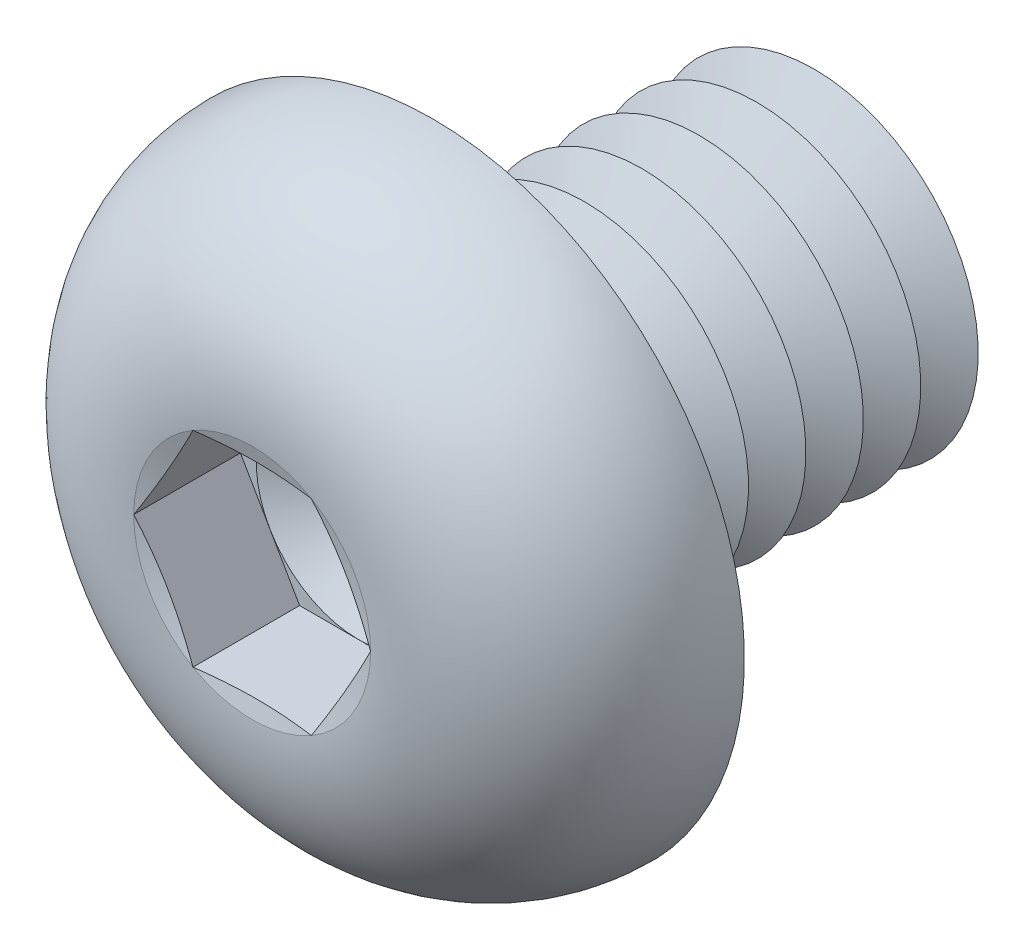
from build123d import *

# Parameters (mm, degrees)
FILLET1_R          = 0.35
LPATTERN1_COUNT    = 7
LPATTERN1_PITCH    = 0.7
CUT_EXTRUDE1_DEPTH = 1.3


with BuildPart() as part:
    # Sketch1 → Revolve1 (revolve)
    with BuildSketch(Plane(origin=(0, 0, 0), x_dir=(0, 0, -1), z_dir=(1, 0, 0))):
        with BuildLine():
            Line((0, 2), (0, 3.8))
            ThreePointArc((0, 3.8), (-1.611961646, 3.099623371), (-2.2, 1.443375))
            Line((-2.2, 1.443375), (-2.006624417, 0.7216875))
            Line((-2.006624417, 0.7216875), (-2.2, 0.7216875))
            Line((-2.2, 0.7216875), (-2.2, 0))
            Line((-2.2, 0), (5, 0))
            Line((5, 0), (5, 2))
            Line((5, 2), (0, 2))
        make_face()
    revolve(axis=Axis((0, 0, -5), (0, 0, 1)))

    # Fillet1
    fillet1_edges = [part.edges().sort_by_distance(p)[0] for p in [
        (0, -2, 0),
    ]]
    fillet(fillet1_edges, radius=FILLET1_R)

    # Sketch2 → Cut-Revolve1 (revolve, cut)
    with BuildSketch(Plane(origin=(0, 0, 0), x_dir=(0, 0, -1), z_dir=(1, 0, 0))):
        Polygon((4.65, 2), (5.35, 2), (5, 1.393782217), align=None)
    cut_revolve1 = revolve(axis=Axis((0, 0, -5), (0, 0, -1)), mode=Mode.SUBTRACT)

    # LPattern1: Cut-Revolve1 ×7
    with Locations(*[(0, 0, i * LPATTERN1_PITCH) for i in range(1, LPATTERN1_COUNT)]):
        add(cut_revolve1, mode=Mode.SUBTRACT)

    # Sketch3 → Cut-Extrude1 (cut)
    with BuildSketch(Plane.XY.offset(2.2)):
        Polygon((0.7216875, 1.249999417), (-0.7216875, 1.249999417), (-1.443375, 0), (-0.7216875, -1.249999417), (0.7216875, -1.249999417), (1.443375, 0), align=None)
    extrude(amount=-CUT_EXTRUDE1_DEPTH, mode=Mode.SUBTRACT)

    # Cut-Extrude2 cone 1 section (on through the dimple's axis) → Cut-Extrude2 (revolve, cut)
    with BuildSketch(Plane(origin=(0, 0, 0.9), x_dir=(0, -1, 0), z_dir=(1, 0, 0))):
        Polygon((0, 0), (1.249999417, 0), (0, 0.7216875), align=None)
    revolve(axis=Axis((0, 0, 0.9), (0, 0, -1)), mode=Mode.SUBTRACT)


solid = part.part
